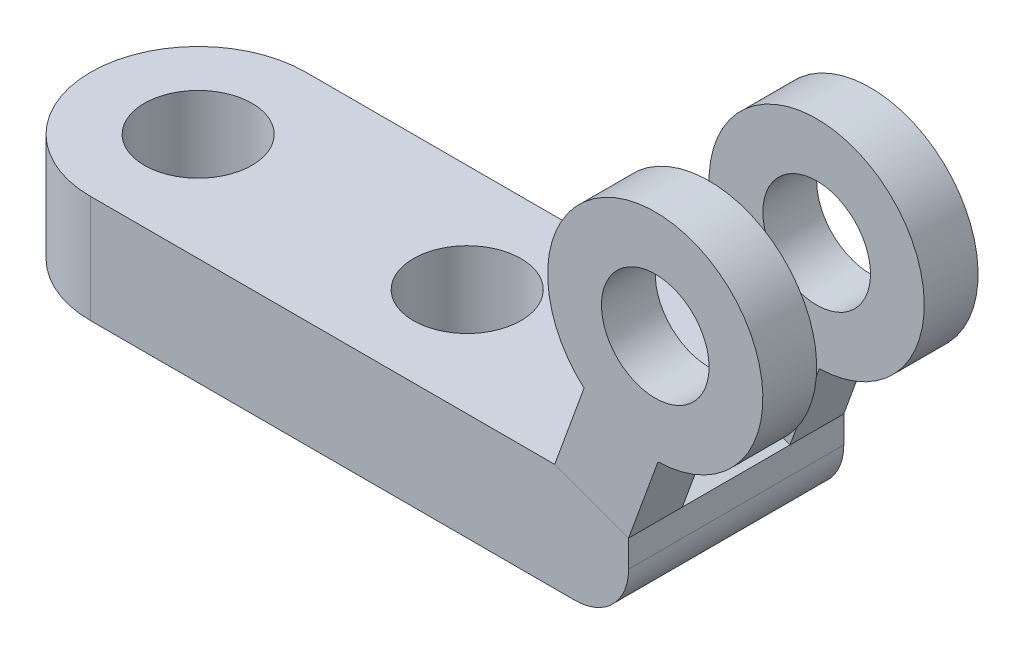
ISO-10303-21;
HEADER;
FILE_DESCRIPTION(('STEP AP214'),'2;1');
FILE_NAME('part.step','',(''),(''),'','','');
FILE_SCHEMA(('AUTOMOTIVE_DESIGN { 1 0 10303 214 1 1 1 1 }'));
ENDSEC;
DATA;
#1=APPLICATION_CONTEXT('core data for automotive mechanical design processes');
#2=APPLICATION_PROTOCOL_DEFINITION('international standard','automotive_design',2000,#1);
#3=PRODUCT_CONTEXT('',#1,'mechanical');
#4=PRODUCT('Part','Part','',(#3));
#5=PRODUCT_RELATED_PRODUCT_CATEGORY('part','',(#4));
#6=PRODUCT_DEFINITION_FORMATION('','',#4);
#7=PRODUCT_DEFINITION_CONTEXT('part definition',#1,'design');
#8=PRODUCT_DEFINITION('design','',#6,#7);
#9=PRODUCT_DEFINITION_SHAPE('','',#8);
#10=(LENGTH_UNIT() NAMED_UNIT(*) SI_UNIT(.MILLI.,.METRE.));
#11=(NAMED_UNIT(*) PLANE_ANGLE_UNIT() SI_UNIT($,.RADIAN.));
#12=(NAMED_UNIT(*) SI_UNIT($,.STERADIAN.) SOLID_ANGLE_UNIT());
#13=UNCERTAINTY_MEASURE_WITH_UNIT(LENGTH_MEASURE(1.E-05),#10,'distance_accuracy_value','');
#14=(GEOMETRIC_REPRESENTATION_CONTEXT(3) GLOBAL_UNCERTAINTY_ASSIGNED_CONTEXT((#13)) GLOBAL_UNIT_ASSIGNED_CONTEXT((#10,
#11,#12)) REPRESENTATION_CONTEXT('',''));
#15=CARTESIAN_POINT('',(0.,0.,0.));
#16=DIRECTION('',(0.,0.,1.));
#17=DIRECTION('',(1.,0.,0.));
#18=AXIS2_PLACEMENT_3D('',#15,#16,#17);
#19=CARTESIAN_POINT('',(4.174065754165,-1.51923569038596,0.5));
#20=DIRECTION('',(0.939692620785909,-0.342020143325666,0.));
#21=DIRECTION('',(0.342020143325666,0.939692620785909,0.));
#22=AXIS2_PLACEMENT_3D('',#19,#20,#21);
#23=PLANE('',#22);
#24=DIRECTION('',(0.342020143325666,0.939692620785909,0.));
#25=VECTOR('',#24,1.);
#26=CARTESIAN_POINT('',(4.174065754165,-1.51923569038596,1.));
#27=LINE('',#26,#25);
#28=CARTESIAN_POINT('',(5.,0.75,1.));
#29=VERTEX_POINT('',#28);
#30=CARTESIAN_POINT('',(5.27297767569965,1.5,1.));
#31=VERTEX_POINT('',#30);
#32=EDGE_CURVE('E136',#29,#31,#27,.T.);
#33=ORIENTED_EDGE('',*,*,#32,.F.);
#34=DIRECTION('',(0.,0.,1.));
#35=VECTOR('',#34,1.);
#36=CARTESIAN_POINT('',(5.,0.75,0.5));
#37=LINE('',#36,#35);
#38=CARTESIAN_POINT('',(5.,0.75,0.5));
#39=VERTEX_POINT('',#38);
#40=EDGE_CURVE('E13',#39,#29,#37,.T.);
#41=ORIENTED_EDGE('',*,*,#40,.F.);
#42=DIRECTION('',(0.342020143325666,0.939692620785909,0.));
#43=VECTOR('',#42,1.);
#44=CARTESIAN_POINT('',(4.174065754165,-1.51923569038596,0.5));
#45=LINE('',#44,#43);
#46=CARTESIAN_POINT('',(5.27297767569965,1.5,0.5));
#47=VERTEX_POINT('',#46);
#48=EDGE_CURVE('E127',#39,#47,#45,.T.);
#49=ORIENTED_EDGE('',*,*,#48,.T.);
#50=DIRECTION('',(0.,0.,1.));
#51=VECTOR('',#50,1.);
#52=CARTESIAN_POINT('',(5.27297767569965,1.5,0.5));
#53=LINE('',#52,#51);
#54=EDGE_CURVE('E69',#47,#31,#53,.T.);
#55=ORIENTED_EDGE('',*,*,#54,.T.);
#56=EDGE_LOOP('',(#33,#41,#49,#55));
#57=FACE_BOUND('',#56,.T.);
#58=ADVANCED_FACE('F66',(#57),#23,.T.);
#59=CARTESIAN_POINT('',(0.825934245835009,2.26923569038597,0.5));
#60=DIRECTION('',(0.342020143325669,0.939692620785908,0.));
#61=DIRECTION('',(-0.939692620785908,0.342020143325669,0.));
#62=AXIS2_PLACEMENT_3D('',#59,#60,#61);
#63=PLANE('',#62);
#64=DIRECTION('',(-0.939692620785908,0.342020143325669,0.));
#65=VECTOR('',#64,1.);
#66=CARTESIAN_POINT('',(0.825934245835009,2.26923569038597,1.));
#67=LINE('',#66,#65);
#68=CARTESIAN_POINT('',(4.31313064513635,1.,1.));
#69=VERTEX_POINT('',#68);
#70=EDGE_CURVE('E99',#29,#69,#67,.T.);
#71=ORIENTED_EDGE('',*,*,#70,.T.);
#72=DIRECTION('',(0.,0.,1.));
#73=VECTOR('',#72,1.);
#74=CARTESIAN_POINT('',(4.31313064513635,1.,0.5));
#75=LINE('',#74,#73);
#76=CARTESIAN_POINT('',(4.31313064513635,1.,0.5));
#77=VERTEX_POINT('',#76);
#78=EDGE_CURVE('E75',#77,#69,#75,.T.);
#79=ORIENTED_EDGE('',*,*,#78,.F.);
#80=DIRECTION('',(-0.939692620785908,0.342020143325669,0.));
#81=VECTOR('',#80,1.);
#82=CARTESIAN_POINT('',(0.825934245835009,2.26923569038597,0.5));
#83=LINE('',#82,#81);
#84=EDGE_CURVE('E117',#39,#77,#83,.T.);
#85=ORIENTED_EDGE('',*,*,#84,.F.);
#86=ORIENTED_EDGE('',*,*,#40,.T.);
#87=EDGE_LOOP('',(#71,#79,#85,#86));
#88=FACE_BOUND('',#87,.T.);
#89=ADVANCED_FACE('F149',(#88),#63,.F.);
#90=CARTESIAN_POINT('',(3.48719639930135,-1.26923569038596,0.5));
#91=DIRECTION('',(0.93969262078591,-0.342020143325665,0.));
#92=DIRECTION('',(0.342020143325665,0.93969262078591,0.));
#93=AXIS2_PLACEMENT_3D('',#90,#91,#92);
#94=PLANE('',#93);
#95=DIRECTION('',(0.342020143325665,0.93969262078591,0.));
#96=VECTOR('',#95,1.);
#97=CARTESIAN_POINT('',(3.48719639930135,-1.26923569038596,1.));
#98=LINE('',#97,#96);
#99=CARTESIAN_POINT('',(4.58610832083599,1.75,1.));
#100=VERTEX_POINT('',#99);
#101=EDGE_CURVE('E124',#69,#100,#98,.T.);
#102=ORIENTED_EDGE('',*,*,#101,.T.);
#103=DIRECTION('',(0.,0.,1.));
#104=VECTOR('',#103,1.);
#105=CARTESIAN_POINT('',(4.58610832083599,1.75,0.5));
#106=LINE('',#105,#104);
#107=CARTESIAN_POINT('',(4.58610832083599,1.75,0.5));
#108=VERTEX_POINT('',#107);
#109=EDGE_CURVE('E121',#108,#100,#106,.T.);
#110=ORIENTED_EDGE('',*,*,#109,.F.);
#111=DIRECTION('',(0.342020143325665,0.93969262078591,0.));
#112=VECTOR('',#111,1.);
#113=CARTESIAN_POINT('',(3.48719639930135,-1.26923569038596,0.5));
#114=LINE('',#113,#112);
#115=EDGE_CURVE('E111',#77,#108,#114,.T.);
#116=ORIENTED_EDGE('',*,*,#115,.F.);
#117=ORIENTED_EDGE('',*,*,#78,.T.);
#118=EDGE_LOOP('',(#102,#110,#116,#117));
#119=FACE_BOUND('',#118,.T.);
#120=ADVANCED_FACE('F122',(#119),#94,.F.);
#121=CARTESIAN_POINT('',(5.2479025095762,2.49968556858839,0.5));
#122=DIRECTION('',(0.,0.,1.));
#123=DIRECTION('',(1.,0.,0.));
#124=AXIS2_PLACEMENT_3D('',#121,#122,#123);
#125=CYLINDRICAL_SURFACE('',#124,1.);
#126=CARTESIAN_POINT('',(5.2479025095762,2.49968556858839,1.));
#127=DIRECTION('',(0.,0.,1.));
#128=DIRECTION('',(1.,0.,0.));
#129=AXIS2_PLACEMENT_3D('',#126,#127,#128);
#130=CIRCLE('',#129,1.);
#131=EDGE_CURVE('E139',#31,#100,#130,.T.);
#132=ORIENTED_EDGE('',*,*,#131,.F.);
#133=ORIENTED_EDGE('',*,*,#54,.F.);
#134=CARTESIAN_POINT('',(5.2479025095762,2.49968556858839,0.5));
#135=DIRECTION('',(0.,0.,1.));
#136=DIRECTION('',(1.,0.,0.));
#137=AXIS2_PLACEMENT_3D('',#134,#135,#136);
#138=CIRCLE('',#137,1.);
#139=EDGE_CURVE('E116',#47,#108,#138,.T.);
#140=ORIENTED_EDGE('',*,*,#139,.T.);
#141=ORIENTED_EDGE('',*,*,#109,.T.);
#142=EDGE_LOOP('',(#132,#133,#140,#141));
#143=FACE_BOUND('',#142,.T.);
#144=ADVANCED_FACE('F126',(#143),#125,.T.);
#145=CARTESIAN_POINT('',(5.2479025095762,2.49968556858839,0.5));
#146=DIRECTION('',(0.,0.,1.));
#147=DIRECTION('',(1.,0.,0.));
#148=AXIS2_PLACEMENT_3D('',#145,#146,#147);
#149=CYLINDRICAL_SURFACE('',#148,0.500000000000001);
#150=CARTESIAN_POINT('',(5.2479025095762,2.49968556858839,0.5));
#151=DIRECTION('',(0.,0.,1.));
#152=DIRECTION('',(1.,0.,0.));
#153=AXIS2_PLACEMENT_3D('',#150,#151,#152);
#154=CIRCLE('',#153,0.500000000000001);
#155=CARTESIAN_POINT('',(5.7479025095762,2.49968556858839,0.5));
#156=VERTEX_POINT('',#155);
#157=EDGE_CURVE('E133',#156,#156,#154,.T.);
#158=ORIENTED_EDGE('',*,*,#157,.F.);
#159=EDGE_LOOP('',(#158));
#160=FACE_BOUND('',#159,.T.);
#161=CARTESIAN_POINT('',(5.2479025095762,2.49968556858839,1.));
#162=DIRECTION('',(0.,0.,1.));
#163=DIRECTION('',(1.,0.,0.));
#164=AXIS2_PLACEMENT_3D('',#161,#162,#163);
#165=CIRCLE('',#164,0.500000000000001);
#166=CARTESIAN_POINT('',(5.7479025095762,2.49968556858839,1.));
#167=VERTEX_POINT('',#166);
#168=EDGE_CURVE('E129',#167,#167,#165,.T.);
#169=ORIENTED_EDGE('',*,*,#168,.T.);
#170=EDGE_LOOP('',(#169));
#171=FACE_BOUND('',#170,.T.);
#172=ADVANCED_FACE('F159',(#160,#171),#149,.F.);
#173=CARTESIAN_POINT('',(0.,0.,0.5));
#174=DIRECTION('',(0.,0.,1.));
#175=DIRECTION('',(1.,0.,0.));
#176=AXIS2_PLACEMENT_3D('',#173,#174,#175);
#177=PLANE('',#176);
#178=ORIENTED_EDGE('',*,*,#48,.F.);
#179=ORIENTED_EDGE('',*,*,#84,.T.);
#180=ORIENTED_EDGE('',*,*,#115,.T.);
#181=ORIENTED_EDGE('',*,*,#139,.F.);
#182=EDGE_LOOP('',(#178,#179,#180,#181));
#183=FACE_BOUND('',#182,.T.);
#184=ORIENTED_EDGE('',*,*,#157,.T.);
#185=EDGE_LOOP('',(#184));
#186=FACE_BOUND('',#185,.T.);
#187=ADVANCED_FACE('F114',(#183,#186),#177,.F.);
#188=CARTESIAN_POINT('',(0.,0.,1.));
#189=DIRECTION('',(0.,0.,1.));
#190=DIRECTION('',(1.,0.,0.));
#191=AXIS2_PLACEMENT_3D('',#188,#189,#190);
#192=PLANE('',#191);
#193=ORIENTED_EDGE('',*,*,#32,.T.);
#194=ORIENTED_EDGE('',*,*,#131,.T.);
#195=ORIENTED_EDGE('',*,*,#101,.F.);
#196=ORIENTED_EDGE('',*,*,#70,.F.);
#197=EDGE_LOOP('',(#193,#194,#195,#196));
#198=FACE_BOUND('',#197,.T.);
#199=ORIENTED_EDGE('',*,*,#168,.F.);
#200=EDGE_LOOP('',(#199));
#201=FACE_BOUND('',#200,.T.);
#202=ADVANCED_FACE('F146',(#198,#201),#192,.T.);
#203=CLOSED_SHELL('',(#58,#89,#120,#144,#172,#187,#202));
#204=MANIFOLD_SOLID_BREP('B2',#203);
#205=CARTESIAN_POINT('',(5.,0.75,-1.73095110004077));
#206=DIRECTION('',(-0.342020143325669,-0.939692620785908,0.));
#207=DIRECTION('',(0.939692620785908,-0.342020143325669,0.));
#208=AXIS2_PLACEMENT_3D('',#205,#206,#207);
#209=PLANE('',#208);
#210=DIRECTION('',(0.939692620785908,-0.342020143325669,0.));
#211=VECTOR('',#210,1.);
#212=CARTESIAN_POINT('',(0.504540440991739,2.38621346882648,-0.5));
#213=LINE('',#212,#211);
#214=CARTESIAN_POINT('',(4.31313064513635,1.,-0.5));
#215=VERTEX_POINT('',#214);
#216=CARTESIAN_POINT('',(5.,0.749999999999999,-0.5));
#217=VERTEX_POINT('',#216);
#218=EDGE_CURVE('E241',#215,#217,#213,.T.);
#219=ORIENTED_EDGE('',*,*,#218,.F.);
#220=DIRECTION('',(0.,0.,1.));
#221=VECTOR('',#220,1.);
#222=CARTESIAN_POINT('',(4.31313064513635,1.,-1.73095110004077));
#223=LINE('',#222,#221);
#224=CARTESIAN_POINT('',(4.31313064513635,1.,1.));
#225=VERTEX_POINT('',#224);
#226=EDGE_CURVE('E343',#215,#225,#223,.T.);
#227=ORIENTED_EDGE('',*,*,#226,.T.);
#228=DIRECTION('',(0.939692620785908,-0.342020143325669,0.));
#229=VECTOR('',#228,1.);
#230=CARTESIAN_POINT('',(5.,0.75,1.));
#231=LINE('',#230,#229);
#232=CARTESIAN_POINT('',(5.,0.75,1.));
#233=VERTEX_POINT('',#232);
#234=EDGE_CURVE('E311',#225,#233,#231,.T.);
#235=ORIENTED_EDGE('',*,*,#234,.T.);
#236=DIRECTION('',(0.,0.,1.));
#237=VECTOR('',#236,1.);
#238=CARTESIAN_POINT('',(5.,0.75,-1.73095110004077));
#239=LINE('',#238,#237);
#240=EDGE_CURVE('E300',#217,#233,#239,.T.);
#241=ORIENTED_EDGE('',*,*,#240,.F.);
#242=EDGE_LOOP('',(#219,#227,#235,#241));
#243=FACE_BOUND('',#242,.T.);
#244=ADVANCED_FACE('F226',(#243),#209,.F.);
#245=CARTESIAN_POINT('',(0.,1.,-1.));
#246=DIRECTION('',(0.,0.,-1.));
#247=DIRECTION('',(-1.,0.,0.));
#248=AXIS2_PLACEMENT_3D('',#245,#246,#247);
#249=PLANE('',#248);
#250=DIRECTION('',(1.,0.,0.));
#251=VECTOR('',#250,1.);
#252=CARTESIAN_POINT('',(0.,1.,-1.));
#253=LINE('',#252,#251);
#254=CARTESIAN_POINT('',(0.,1.,-1.));
#255=VERTEX_POINT('',#254);
#256=CARTESIAN_POINT('',(4.31313064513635,1.,-1.));
#257=VERTEX_POINT('',#256);
#258=EDGE_CURVE('E349',#255,#257,#253,.T.);
#259=ORIENTED_EDGE('',*,*,#258,.T.);
#260=DIRECTION('',(-0.342020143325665,-0.93969262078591,0.));
#261=VECTOR('',#260,1.);
#262=CARTESIAN_POINT('',(3.80859020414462,-0.386213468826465,-1.));
#263=LINE('',#262,#261);
#264=CARTESIAN_POINT('',(4.58610832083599,1.75,-1.));
#265=VERTEX_POINT('',#264);
#266=EDGE_CURVE('E322',#265,#257,#263,.T.);
#267=ORIENTED_EDGE('',*,*,#266,.F.);
#268=CARTESIAN_POINT('',(5.2479025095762,2.49968556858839,-1.));
#269=DIRECTION('',(0.,0.,-1.));
#270=DIRECTION('',(-1.,0.,0.));
#271=AXIS2_PLACEMENT_3D('',#268,#269,#270);
#272=CIRCLE('',#271,1.);
#273=CARTESIAN_POINT('',(5.27297767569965,1.5,-1.));
#274=VERTEX_POINT('',#273);
#275=EDGE_CURVE('E335',#265,#274,#272,.T.);
#276=ORIENTED_EDGE('',*,*,#275,.T.);
#277=DIRECTION('',(-0.342020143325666,-0.939692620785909,0.));
#278=VECTOR('',#277,1.);
#279=CARTESIAN_POINT('',(4.49545955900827,-0.636213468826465,-1.));
#280=LINE('',#279,#278);
#281=CARTESIAN_POINT('',(5.,0.75,-1.));
#282=VERTEX_POINT('',#281);
#283=EDGE_CURVE('E333',#274,#282,#280,.T.);
#284=ORIENTED_EDGE('',*,*,#283,.T.);
#285=DIRECTION('',(0.,-1.,0.));
#286=VECTOR('',#285,1.);
#287=CARTESIAN_POINT('',(5.,1.,-1.));
#288=LINE('',#287,#286);
#289=CARTESIAN_POINT('',(5.,0.5,-1.));
#290=VERTEX_POINT('',#289);
#291=EDGE_CURVE('E303',#282,#290,#288,.T.);
#292=ORIENTED_EDGE('',*,*,#291,.T.);
#293=CARTESIAN_POINT('',(4.5,0.5,-1.));
#294=DIRECTION('',(0.,0.,-1.));
#295=DIRECTION('',(-1.,0.,0.));
#296=AXIS2_PLACEMENT_3D('',#293,#294,#295);
#297=CIRCLE('',#296,0.5);
#298=CARTESIAN_POINT('',(4.5,0.,-1.));
#299=VERTEX_POINT('',#298);
#300=EDGE_CURVE('E384',#290,#299,#297,.T.);
#301=ORIENTED_EDGE('',*,*,#300,.T.);
#302=DIRECTION('',(1.,0.,0.));
#303=VECTOR('',#302,1.);
#304=CARTESIAN_POINT('',(0.,0.,-1.));
#305=LINE('',#304,#303);
#306=CARTESIAN_POINT('',(0.,0.,-1.));
#307=VERTEX_POINT('',#306);
#308=EDGE_CURVE('E363',#307,#299,#305,.T.);
#309=ORIENTED_EDGE('',*,*,#308,.F.);
#310=DIRECTION('',(0.,-1.,0.));
#311=VECTOR('',#310,1.);
#312=CARTESIAN_POINT('',(0.,1.,-1.));
#313=LINE('',#312,#311);
#314=EDGE_CURVE('E380',#255,#307,#313,.T.);
#315=ORIENTED_EDGE('',*,*,#314,.F.);
#316=EDGE_LOOP('',(#259,#267,#276,#284,#292,#301,#309,#315));
#317=FACE_BOUND('',#316,.T.);
#318=CARTESIAN_POINT('',(5.2479025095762,2.49968556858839,-1.));
#319=DIRECTION('',(0.,0.,-1.));
#320=DIRECTION('',(-1.,0.,0.));
#321=AXIS2_PLACEMENT_3D('',#318,#319,#320);
#322=CIRCLE('',#321,0.500000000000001);
#323=CARTESIAN_POINT('',(4.7479025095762,2.49968556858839,-1.));
#324=VERTEX_POINT('',#323);
#325=EDGE_CURVE('E543',#324,#324,#322,.T.);
#326=ORIENTED_EDGE('',*,*,#325,.F.);
#327=EDGE_LOOP('',(#326));
#328=FACE_BOUND('',#327,.T.);
#329=ADVANCED_FACE('F404',(#317,#328),#249,.T.);
#330=CARTESIAN_POINT('',(0.,1.,0.));
#331=DIRECTION('',(0.,-1.,0.));
#332=DIRECTION('',(0.,0.,-1.));
#333=AXIS2_PLACEMENT_3D('',#330,#331,#332);
#334=CYLINDRICAL_SURFACE('',#333,1.);
#335=CARTESIAN_POINT('',(0.,0.,0.));
#336=DIRECTION('',(0.,1.,0.));
#337=DIRECTION('',(0.,0.,1.));
#338=AXIS2_PLACEMENT_3D('',#335,#336,#337);
#339=CIRCLE('',#338,1.);
#340=CARTESIAN_POINT('',(0.,0.,1.));
#341=VERTEX_POINT('',#340);
#342=EDGE_CURVE('E366',#307,#341,#339,.T.);
#343=ORIENTED_EDGE('',*,*,#342,.T.);
#344=DIRECTION('',(0.,-1.,0.));
#345=VECTOR('',#344,1.);
#346=CARTESIAN_POINT('',(0.,1.,1.));
#347=LINE('',#346,#345);
#348=CARTESIAN_POINT('',(0.,1.,1.));
#349=VERTEX_POINT('',#348);
#350=EDGE_CURVE('E377',#349,#341,#347,.T.);
#351=ORIENTED_EDGE('',*,*,#350,.F.);
#352=CARTESIAN_POINT('',(0.,1.,0.));
#353=DIRECTION('',(0.,1.,0.));
#354=DIRECTION('',(0.,0.,1.));
#355=AXIS2_PLACEMENT_3D('',#352,#353,#354);
#356=CIRCLE('',#355,1.);
#357=EDGE_CURVE('E352',#255,#349,#356,.T.);
#358=ORIENTED_EDGE('',*,*,#357,.F.);
#359=ORIENTED_EDGE('',*,*,#314,.T.);
#360=EDGE_LOOP('',(#343,#351,#358,#359));
#361=FACE_BOUND('',#360,.T.);
#362=ADVANCED_FACE('F402',(#361),#334,.T.);
#363=CARTESIAN_POINT('',(0.,1.,1.));
#364=DIRECTION('',(0.,0.,-1.));
#365=DIRECTION('',(-1.,0.,0.));
#366=AXIS2_PLACEMENT_3D('',#363,#364,#365);
#367=PLANE('',#366);
#368=DIRECTION('',(0.,-1.,0.));
#369=VECTOR('',#368,1.);
#370=CARTESIAN_POINT('',(5.,1.,1.));
#371=LINE('',#370,#369);
#372=CARTESIAN_POINT('',(5.,0.5,1.));
#373=VERTEX_POINT('',#372);
#374=EDGE_CURVE('E375',#233,#373,#371,.T.);
#375=ORIENTED_EDGE('',*,*,#374,.F.);
#376=ORIENTED_EDGE('',*,*,#234,.F.);
#377=DIRECTION('',(1.,0.,0.));
#378=VECTOR('',#377,1.);
#379=CARTESIAN_POINT('',(0.,1.,1.));
#380=LINE('',#379,#378);
#381=EDGE_CURVE('E355',#349,#225,#380,.T.);
#382=ORIENTED_EDGE('',*,*,#381,.F.);
#383=ORIENTED_EDGE('',*,*,#350,.T.);
#384=DIRECTION('',(1.,0.,0.));
#385=VECTOR('',#384,1.);
#386=CARTESIAN_POINT('',(0.,0.,1.));
#387=LINE('',#386,#385);
#388=CARTESIAN_POINT('',(4.5,0.,1.));
#389=VERTEX_POINT('',#388);
#390=EDGE_CURVE('E369',#341,#389,#387,.T.);
#391=ORIENTED_EDGE('',*,*,#390,.T.);
#392=CARTESIAN_POINT('',(4.5,0.5,1.));
#393=DIRECTION('',(0.,0.,-1.));
#394=DIRECTION('',(-1.,0.,0.));
#395=AXIS2_PLACEMENT_3D('',#392,#393,#394);
#396=CIRCLE('',#395,0.5);
#397=EDGE_CURVE('E64',#389,#373,#396,.F.);
#398=ORIENTED_EDGE('',*,*,#397,.T.);
#399=EDGE_LOOP('',(#375,#376,#382,#383,#391,#398));
#400=FACE_BOUND('',#399,.T.);
#401=ADVANCED_FACE('F395',(#400),#367,.F.);
#402=CARTESIAN_POINT('',(5.,1.,0.));
#403=DIRECTION('',(-1.,0.,0.));
#404=DIRECTION('',(0.,0.,1.));
#405=AXIS2_PLACEMENT_3D('',#402,#403,#404);
#406=PLANE('',#405);
#407=ORIENTED_EDGE('',*,*,#291,.F.);
#408=EDGE_CURVE('E298',#282,#217,#239,.T.);
#409=ORIENTED_EDGE('',*,*,#408,.T.);
#410=ORIENTED_EDGE('',*,*,#240,.T.);
#411=ORIENTED_EDGE('',*,*,#374,.T.);
#412=DIRECTION('',(0.,0.,-1.));
#413=VECTOR('',#412,1.);
#414=CARTESIAN_POINT('',(5.,0.5,0.));
#415=LINE('',#414,#413);
#416=EDGE_CURVE('E382',#373,#290,#415,.T.);
#417=ORIENTED_EDGE('',*,*,#416,.T.);
#418=EDGE_LOOP('',(#407,#409,#410,#411,#417));
#419=FACE_BOUND('',#418,.T.);
#420=ADVANCED_FACE('F299',(#419),#406,.F.);
#421=CARTESIAN_POINT('',(2.5,1.,0.));
#422=DIRECTION('',(0.,-1.,0.));
#423=DIRECTION('',(0.,0.,-1.));
#424=AXIS2_PLACEMENT_3D('',#421,#422,#423);
#425=CYLINDRICAL_SURFACE('',#424,0.5);
#426=CARTESIAN_POINT('',(2.5,1.,0.));
#427=DIRECTION('',(0.,1.,0.));
#428=DIRECTION('',(0.,0.,1.));
#429=AXIS2_PLACEMENT_3D('',#426,#427,#428);
#430=CIRCLE('',#429,0.5);
#431=CARTESIAN_POINT('',(2.5,1.,0.5));
#432=VERTEX_POINT('',#431);
#433=EDGE_CURVE('E346',#432,#432,#430,.T.);
#434=ORIENTED_EDGE('',*,*,#433,.T.);
#435=EDGE_LOOP('',(#434));
#436=FACE_BOUND('',#435,.T.);
#437=CARTESIAN_POINT('',(2.5,0.,0.));
#438=DIRECTION('',(0.,1.,0.));
#439=DIRECTION('',(0.,0.,1.));
#440=AXIS2_PLACEMENT_3D('',#437,#438,#439);
#441=CIRCLE('',#440,0.5);
#442=CARTESIAN_POINT('',(2.5,0.,0.5));
#443=VERTEX_POINT('',#442);
#444=EDGE_CURVE('E308',#443,#443,#441,.T.);
#445=ORIENTED_EDGE('',*,*,#444,.F.);
#446=EDGE_LOOP('',(#445));
#447=FACE_BOUND('',#446,.T.);
#448=ADVANCED_FACE('F439',(#436,#447),#425,.F.);
#449=CARTESIAN_POINT('',(0.,1.,0.));
#450=DIRECTION('',(0.,-1.,0.));
#451=DIRECTION('',(0.,0.,-1.));
#452=AXIS2_PLACEMENT_3D('',#449,#450,#451);
#453=CYLINDRICAL_SURFACE('',#452,0.5);
#454=CARTESIAN_POINT('',(0.,1.,0.));
#455=DIRECTION('',(0.,1.,0.));
#456=DIRECTION('',(0.,0.,1.));
#457=AXIS2_PLACEMENT_3D('',#454,#455,#456);
#458=CIRCLE('',#457,0.5);
#459=CARTESIAN_POINT('',(0.,1.,0.5));
#460=VERTEX_POINT('',#459);
#461=EDGE_CURVE('E358',#460,#460,#458,.T.);
#462=ORIENTED_EDGE('',*,*,#461,.T.);
#463=EDGE_LOOP('',(#462));
#464=FACE_BOUND('',#463,.T.);
#465=CARTESIAN_POINT('',(0.,0.,0.));
#466=DIRECTION('',(0.,1.,0.));
#467=DIRECTION('',(0.,0.,1.));
#468=AXIS2_PLACEMENT_3D('',#465,#466,#467);
#469=CIRCLE('',#468,0.5);
#470=CARTESIAN_POINT('',(0.,0.,0.5));
#471=VERTEX_POINT('',#470);
#472=EDGE_CURVE('E350',#471,#471,#469,.T.);
#473=ORIENTED_EDGE('',*,*,#472,.F.);
#474=EDGE_LOOP('',(#473));
#475=FACE_BOUND('',#474,.T.);
#476=ADVANCED_FACE('F433',(#464,#475),#453,.F.);
#477=CARTESIAN_POINT('',(0.,1.,0.));
#478=DIRECTION('',(0.,1.,0.));
#479=DIRECTION('',(0.,0.,1.));
#480=AXIS2_PLACEMENT_3D('',#477,#478,#479);
#481=PLANE('',#480);
#482=EDGE_CURVE('E248',#257,#215,#223,.T.);
#483=ORIENTED_EDGE('',*,*,#482,.F.);
#484=ORIENTED_EDGE('',*,*,#258,.F.);
#485=ORIENTED_EDGE('',*,*,#357,.T.);
#486=ORIENTED_EDGE('',*,*,#381,.T.);
#487=ORIENTED_EDGE('',*,*,#226,.F.);
#488=EDGE_LOOP('',(#483,#484,#485,#486,#487));
#489=FACE_BOUND('',#488,.T.);
#490=ORIENTED_EDGE('',*,*,#433,.F.);
#491=EDGE_LOOP('',(#490));
#492=FACE_BOUND('',#491,.T.);
#493=ORIENTED_EDGE('',*,*,#461,.F.);
#494=EDGE_LOOP('',(#493));
#495=FACE_BOUND('',#494,.T.);
#496=ADVANCED_FACE('F398',(#489,#492,#495),#481,.T.);
#497=CARTESIAN_POINT('',(0.,0.,0.));
#498=DIRECTION('',(0.,1.,0.));
#499=DIRECTION('',(0.,0.,1.));
#500=AXIS2_PLACEMENT_3D('',#497,#498,#499);
#501=PLANE('',#500);
#502=ORIENTED_EDGE('',*,*,#444,.T.);
#503=EDGE_LOOP('',(#502));
#504=FACE_BOUND('',#503,.T.);
#505=ORIENTED_EDGE('',*,*,#308,.T.);
#506=DIRECTION('',(0.,0.,-1.));
#507=VECTOR('',#506,1.);
#508=CARTESIAN_POINT('',(4.5,0.,0.));
#509=LINE('',#508,#507);
#510=EDGE_CURVE('E234',#299,#389,#509,.F.);
#511=ORIENTED_EDGE('',*,*,#510,.T.);
#512=ORIENTED_EDGE('',*,*,#390,.F.);
#513=ORIENTED_EDGE('',*,*,#342,.F.);
#514=EDGE_LOOP('',(#505,#511,#512,#513));
#515=FACE_BOUND('',#514,.T.);
#516=ORIENTED_EDGE('',*,*,#472,.T.);
#517=EDGE_LOOP('',(#516));
#518=FACE_BOUND('',#517,.T.);
#519=ADVANCED_FACE('F387',(#504,#515,#518),#501,.F.);
#520=CARTESIAN_POINT('',(4.5,0.5,0.));
#521=DIRECTION('',(0.,0.,-1.));
#522=DIRECTION('',(-1.,0.,0.));
#523=AXIS2_PLACEMENT_3D('',#520,#521,#522);
#524=CYLINDRICAL_SURFACE('',#523,0.5);
#525=ORIENTED_EDGE('',*,*,#397,.F.);
#526=ORIENTED_EDGE('',*,*,#510,.F.);
#527=ORIENTED_EDGE('',*,*,#300,.F.);
#528=ORIENTED_EDGE('',*,*,#416,.F.);
#529=EDGE_LOOP('',(#525,#526,#527,#528));
#530=FACE_BOUND('',#529,.T.);
#531=ADVANCED_FACE('F228',(#530),#524,.T.);
#532=CARTESIAN_POINT('',(4.49545955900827,-0.636213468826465,-0.5));
#533=DIRECTION('',(0.939692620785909,-0.342020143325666,0.));
#534=DIRECTION('',(0.342020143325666,0.939692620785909,0.));
#535=AXIS2_PLACEMENT_3D('',#532,#533,#534);
#536=PLANE('',#535);
#537=ORIENTED_EDGE('',*,*,#283,.F.);
#538=DIRECTION('',(0.,0.,-1.));
#539=VECTOR('',#538,1.);
#540=CARTESIAN_POINT('',(5.27297767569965,1.5,-0.5));
#541=LINE('',#540,#539);
#542=CARTESIAN_POINT('',(5.27297767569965,1.5,-0.5));
#543=VERTEX_POINT('',#542);
#544=EDGE_CURVE('E325',#543,#274,#541,.T.);
#545=ORIENTED_EDGE('',*,*,#544,.F.);
#546=DIRECTION('',(-0.342020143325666,-0.939692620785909,0.));
#547=VECTOR('',#546,1.);
#548=CARTESIAN_POINT('',(4.49545955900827,-0.636213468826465,-0.5));
#549=LINE('',#548,#547);
#550=EDGE_CURVE('E318',#543,#217,#549,.T.);
#551=ORIENTED_EDGE('',*,*,#550,.T.);
#552=ORIENTED_EDGE('',*,*,#408,.F.);
#553=EDGE_LOOP('',(#537,#545,#551,#552));
#554=FACE_BOUND('',#553,.T.);
#555=ADVANCED_FACE('F324',(#554),#536,.T.);
#556=CARTESIAN_POINT('',(5.2479025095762,2.49968556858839,-0.5));
#557=DIRECTION('',(0.,0.,-1.));
#558=DIRECTION('',(-1.,0.,0.));
#559=AXIS2_PLACEMENT_3D('',#556,#557,#558);
#560=CYLINDRICAL_SURFACE('',#559,1.);
#561=ORIENTED_EDGE('',*,*,#275,.F.);
#562=DIRECTION('',(0.,0.,-1.));
#563=VECTOR('',#562,1.);
#564=CARTESIAN_POINT('',(4.58610832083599,1.75,-0.5));
#565=LINE('',#564,#563);
#566=CARTESIAN_POINT('',(4.58610832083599,1.75,-0.5));
#567=VERTEX_POINT('',#566);
#568=EDGE_CURVE('E332',#567,#265,#565,.T.);
#569=ORIENTED_EDGE('',*,*,#568,.F.);
#570=CARTESIAN_POINT('',(5.2479025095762,2.49968556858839,-0.5));
#571=DIRECTION('',(0.,0.,-1.));
#572=DIRECTION('',(-1.,0.,0.));
#573=AXIS2_PLACEMENT_3D('',#570,#571,#572);
#574=CIRCLE('',#573,1.);
#575=EDGE_CURVE('E326',#567,#543,#574,.T.);
#576=ORIENTED_EDGE('',*,*,#575,.T.);
#577=ORIENTED_EDGE('',*,*,#544,.T.);
#578=EDGE_LOOP('',(#561,#569,#576,#577));
#579=FACE_BOUND('',#578,.T.);
#580=ADVANCED_FACE('F409',(#579),#560,.T.);
#581=CARTESIAN_POINT('',(3.80859020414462,-0.386213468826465,-0.5));
#582=DIRECTION('',(0.93969262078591,-0.342020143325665,0.));
#583=DIRECTION('',(0.342020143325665,0.93969262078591,0.));
#584=AXIS2_PLACEMENT_3D('',#581,#582,#583);
#585=PLANE('',#584);
#586=ORIENTED_EDGE('',*,*,#266,.T.);
#587=ORIENTED_EDGE('',*,*,#482,.T.);
#588=DIRECTION('',(-0.342020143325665,-0.93969262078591,0.));
#589=VECTOR('',#588,1.);
#590=CARTESIAN_POINT('',(3.80859020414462,-0.386213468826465,-0.5));
#591=LINE('',#590,#589);
#592=EDGE_CURVE('E321',#567,#215,#591,.T.);
#593=ORIENTED_EDGE('',*,*,#592,.F.);
#594=ORIENTED_EDGE('',*,*,#568,.T.);
#595=EDGE_LOOP('',(#586,#587,#593,#594));
#596=FACE_BOUND('',#595,.T.);
#597=ADVANCED_FACE('F411',(#596),#585,.F.);
#598=CARTESIAN_POINT('',(5.2479025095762,2.49968556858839,-0.5));
#599=DIRECTION('',(0.,0.,-1.));
#600=DIRECTION('',(-1.,0.,0.));
#601=AXIS2_PLACEMENT_3D('',#598,#599,#600);
#602=PLANE('',#601);
#603=CARTESIAN_POINT('',(5.2479025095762,2.49968556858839,-0.5));
#604=DIRECTION('',(0.,0.,-1.));
#605=DIRECTION('',(-1.,0.,0.));
#606=AXIS2_PLACEMENT_3D('',#603,#604,#605);
#607=CIRCLE('',#606,0.500000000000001);
#608=CARTESIAN_POINT('',(4.7479025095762,2.49968556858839,-0.5));
#609=VERTEX_POINT('',#608);
#610=EDGE_CURVE('E336',#609,#609,#607,.T.);
#611=ORIENTED_EDGE('',*,*,#610,.T.);
#612=EDGE_LOOP('',(#611));
#613=FACE_BOUND('',#612,.T.);
#614=ORIENTED_EDGE('',*,*,#218,.T.);
#615=ORIENTED_EDGE('',*,*,#550,.F.);
#616=ORIENTED_EDGE('',*,*,#575,.F.);
#617=ORIENTED_EDGE('',*,*,#592,.T.);
#618=EDGE_LOOP('',(#614,#615,#616,#617));
#619=FACE_BOUND('',#618,.T.);
#620=ADVANCED_FACE('F316',(#613,#619),#602,.F.);
#621=CARTESIAN_POINT('',(5.2479025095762,2.49968556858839,-0.5));
#622=DIRECTION('',(0.,0.,-1.));
#623=DIRECTION('',(-1.,0.,0.));
#624=AXIS2_PLACEMENT_3D('',#621,#622,#623);
#625=CYLINDRICAL_SURFACE('',#624,0.500000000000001);
#626=ORIENTED_EDGE('',*,*,#610,.F.);
#627=EDGE_LOOP('',(#626));
#628=FACE_BOUND('',#627,.T.);
#629=ORIENTED_EDGE('',*,*,#325,.T.);
#630=EDGE_LOOP('',(#629));
#631=FACE_BOUND('',#630,.T.);
#632=ADVANCED_FACE('F418',(#628,#631),#625,.F.);
#633=CLOSED_SHELL('',(#244,#329,#362,#401,#420,#448,#476,#496,#519,#531,#555,#580,#597,#620,#632));
#634=MANIFOLD_SOLID_BREP('B7',#633);
#635=ADVANCED_BREP_SHAPE_REPRESENTATION('',(#18,#204,#634),#14);
#636=SHAPE_DEFINITION_REPRESENTATION(#9,#635);
ENDSEC;
END-ISO-10303-21;
